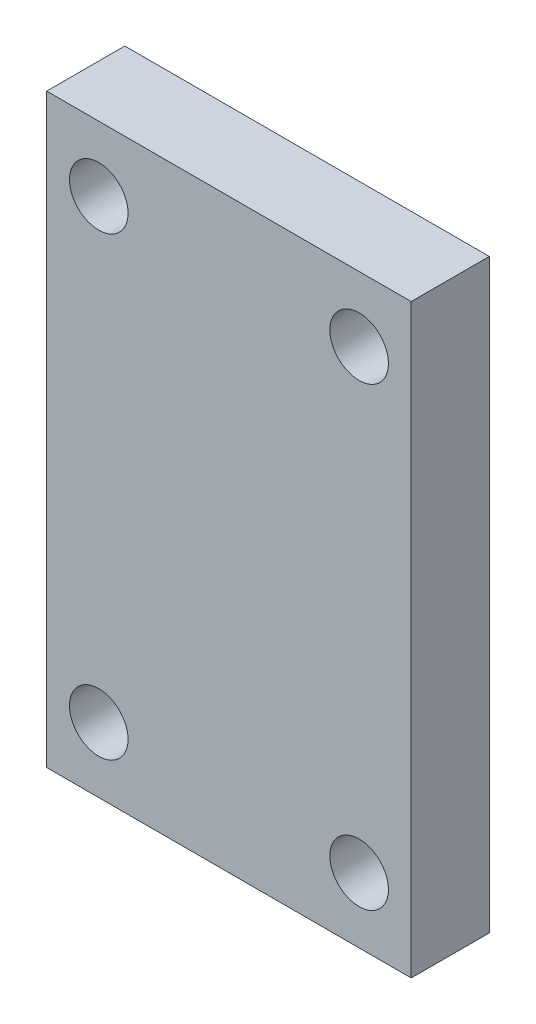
ISO-10303-21;
HEADER;
FILE_DESCRIPTION(('STEP AP214'),'2;1');
FILE_NAME('part.step','',(''),(''),'','','');
FILE_SCHEMA(('AUTOMOTIVE_DESIGN { 1 0 10303 214 1 1 1 1 }'));
ENDSEC;
DATA;
#1=APPLICATION_CONTEXT('core data for automotive mechanical design processes');
#2=APPLICATION_PROTOCOL_DEFINITION('international standard','automotive_design',2000,#1);
#3=PRODUCT_CONTEXT('',#1,'mechanical');
#4=PRODUCT('Part','Part','',(#3));
#5=PRODUCT_RELATED_PRODUCT_CATEGORY('part','',(#4));
#6=PRODUCT_DEFINITION_FORMATION('','',#4);
#7=PRODUCT_DEFINITION_CONTEXT('part definition',#1,'design');
#8=PRODUCT_DEFINITION('design','',#6,#7);
#9=PRODUCT_DEFINITION_SHAPE('','',#8);
#10=(LENGTH_UNIT() NAMED_UNIT(*) SI_UNIT(.MILLI.,.METRE.));
#11=(NAMED_UNIT(*) PLANE_ANGLE_UNIT() SI_UNIT($,.RADIAN.));
#12=(NAMED_UNIT(*) SI_UNIT($,.STERADIAN.) SOLID_ANGLE_UNIT());
#13=UNCERTAINTY_MEASURE_WITH_UNIT(LENGTH_MEASURE(1.E-05),#10,'distance_accuracy_value','');
#14=(GEOMETRIC_REPRESENTATION_CONTEXT(3) GLOBAL_UNCERTAINTY_ASSIGNED_CONTEXT((#13)) GLOBAL_UNIT_ASSIGNED_CONTEXT((#10,
#11,#12)) REPRESENTATION_CONTEXT('',''));
#15=CARTESIAN_POINT('',(0.,0.,0.));
#16=DIRECTION('',(0.,0.,1.));
#17=DIRECTION('',(1.,0.,0.));
#18=AXIS2_PLACEMENT_3D('',#15,#16,#17);
#19=CARTESIAN_POINT('',(0.,0.,6.));
#20=DIRECTION('',(0.,0.,-1.));
#21=DIRECTION('',(-1.,0.,0.));
#22=AXIS2_PLACEMENT_3D('',#19,#20,#21);
#23=PLANE('',#22);
#24=CARTESIAN_POINT('',(4.,-40.,6.));
#25=DIRECTION('',(0.,0.,1.));
#26=DIRECTION('',(1.,0.,0.));
#27=AXIS2_PLACEMENT_3D('',#24,#25,#26);
#28=CIRCLE('',#27,2.25);
#29=CARTESIAN_POINT('',(6.25,-40.,6.));
#30=VERTEX_POINT('',#29);
#31=EDGE_CURVE('E120',#30,#30,#28,.T.);
#32=ORIENTED_EDGE('',*,*,#31,.F.);
#33=EDGE_LOOP('',(#32));
#34=FACE_BOUND('',#33,.T.);
#35=CARTESIAN_POINT('',(24.,-5.,6.));
#36=DIRECTION('',(0.,0.,1.));
#37=DIRECTION('',(1.,0.,0.));
#38=AXIS2_PLACEMENT_3D('',#35,#36,#37);
#39=CIRCLE('',#38,2.25);
#40=CARTESIAN_POINT('',(26.25,-5.,6.));
#41=VERTEX_POINT('',#40);
#42=EDGE_CURVE('E99',#41,#41,#39,.T.);
#43=ORIENTED_EDGE('',*,*,#42,.F.);
#44=EDGE_LOOP('',(#43));
#45=FACE_BOUND('',#44,.T.);
#46=DIRECTION('',(0.,-1.,0.));
#47=VECTOR('',#46,1.);
#48=CARTESIAN_POINT('',(0.,-45.,6.));
#49=LINE('',#48,#47);
#50=CARTESIAN_POINT('',(0.,0.,6.));
#51=VERTEX_POINT('',#50);
#52=CARTESIAN_POINT('',(0.,-45.,6.));
#53=VERTEX_POINT('',#52);
#54=EDGE_CURVE('E84',#51,#53,#49,.T.);
#55=ORIENTED_EDGE('',*,*,#54,.T.);
#56=DIRECTION('',(1.,0.,0.));
#57=VECTOR('',#56,1.);
#58=CARTESIAN_POINT('',(0.,-45.,6.));
#59=LINE('',#58,#57);
#60=CARTESIAN_POINT('',(28.,-45.,6.));
#61=VERTEX_POINT('',#60);
#62=EDGE_CURVE('E79',#53,#61,#59,.T.);
#63=ORIENTED_EDGE('',*,*,#62,.T.);
#64=DIRECTION('',(0.,1.,0.));
#65=VECTOR('',#64,1.);
#66=CARTESIAN_POINT('',(28.,-45.,6.));
#67=LINE('',#66,#65);
#68=CARTESIAN_POINT('',(28.,0.,6.));
#69=VERTEX_POINT('',#68);
#70=EDGE_CURVE('E82',#61,#69,#67,.T.);
#71=ORIENTED_EDGE('',*,*,#70,.T.);
#72=DIRECTION('',(-1.,0.,0.));
#73=VECTOR('',#72,1.);
#74=CARTESIAN_POINT('',(0.,0.,6.));
#75=LINE('',#74,#73);
#76=EDGE_CURVE('E49',#69,#51,#75,.T.);
#77=ORIENTED_EDGE('',*,*,#76,.T.);
#78=EDGE_LOOP('',(#55,#63,#71,#77));
#79=FACE_BOUND('',#78,.T.);
#80=CARTESIAN_POINT('',(4.,-5.,6.));
#81=DIRECTION('',(0.,0.,1.));
#82=DIRECTION('',(1.,0.,0.));
#83=AXIS2_PLACEMENT_3D('',#80,#81,#82);
#84=CIRCLE('',#83,2.25);
#85=CARTESIAN_POINT('',(6.25,-5.,6.));
#86=VERTEX_POINT('',#85);
#87=EDGE_CURVE('E114',#86,#86,#84,.T.);
#88=ORIENTED_EDGE('',*,*,#87,.F.);
#89=EDGE_LOOP('',(#88));
#90=FACE_BOUND('',#89,.T.);
#91=CARTESIAN_POINT('',(24.,-40.,6.));
#92=DIRECTION('',(0.,0.,1.));
#93=DIRECTION('',(1.,0.,0.));
#94=AXIS2_PLACEMENT_3D('',#91,#92,#93);
#95=CIRCLE('',#94,2.25);
#96=CARTESIAN_POINT('',(26.25,-40.,6.));
#97=VERTEX_POINT('',#96);
#98=EDGE_CURVE('E126',#97,#97,#95,.T.);
#99=ORIENTED_EDGE('',*,*,#98,.F.);
#100=EDGE_LOOP('',(#99));
#101=FACE_BOUND('',#100,.T.);
#102=ADVANCED_FACE('F32',(#34,#45,#79,#90,#101),#23,.F.);
#103=CARTESIAN_POINT('',(0.,0.,0.));
#104=DIRECTION('',(0.,0.,-1.));
#105=DIRECTION('',(-1.,0.,0.));
#106=AXIS2_PLACEMENT_3D('',#103,#104,#105);
#107=PLANE('',#106);
#108=CARTESIAN_POINT('',(4.,-40.,0.));
#109=DIRECTION('',(0.,0.,1.));
#110=DIRECTION('',(1.,0.,0.));
#111=AXIS2_PLACEMENT_3D('',#108,#109,#110);
#112=CIRCLE('',#111,2.25);
#113=CARTESIAN_POINT('',(6.25,-40.,0.));
#114=VERTEX_POINT('',#113);
#115=EDGE_CURVE('E123',#114,#114,#112,.T.);
#116=ORIENTED_EDGE('',*,*,#115,.T.);
#117=EDGE_LOOP('',(#116));
#118=FACE_BOUND('',#117,.T.);
#119=CARTESIAN_POINT('',(24.,-5.,0.));
#120=DIRECTION('',(0.,0.,1.));
#121=DIRECTION('',(1.,0.,0.));
#122=AXIS2_PLACEMENT_3D('',#119,#120,#121);
#123=CIRCLE('',#122,2.25);
#124=CARTESIAN_POINT('',(26.25,-5.,0.));
#125=VERTEX_POINT('',#124);
#126=EDGE_CURVE('E111',#125,#125,#123,.T.);
#127=ORIENTED_EDGE('',*,*,#126,.T.);
#128=EDGE_LOOP('',(#127));
#129=FACE_BOUND('',#128,.T.);
#130=DIRECTION('',(0.,-1.,0.));
#131=VECTOR('',#130,1.);
#132=CARTESIAN_POINT('',(0.,-45.,0.));
#133=LINE('',#132,#131);
#134=CARTESIAN_POINT('',(0.,0.,0.));
#135=VERTEX_POINT('',#134);
#136=CARTESIAN_POINT('',(0.,-45.,0.));
#137=VERTEX_POINT('',#136);
#138=EDGE_CURVE('E96',#135,#137,#133,.T.);
#139=ORIENTED_EDGE('',*,*,#138,.F.);
#140=DIRECTION('',(-1.,0.,0.));
#141=VECTOR('',#140,1.);
#142=CARTESIAN_POINT('',(0.,0.,0.));
#143=LINE('',#142,#141);
#144=CARTESIAN_POINT('',(28.,0.,0.));
#145=VERTEX_POINT('',#144);
#146=EDGE_CURVE('E72',#145,#135,#143,.T.);
#147=ORIENTED_EDGE('',*,*,#146,.F.);
#148=DIRECTION('',(0.,1.,0.));
#149=VECTOR('',#148,1.);
#150=CARTESIAN_POINT('',(28.,-45.,0.));
#151=LINE('',#150,#149);
#152=CARTESIAN_POINT('',(28.,-45.,0.));
#153=VERTEX_POINT('',#152);
#154=EDGE_CURVE('E66',#153,#145,#151,.T.);
#155=ORIENTED_EDGE('',*,*,#154,.F.);
#156=DIRECTION('',(1.,0.,0.));
#157=VECTOR('',#156,1.);
#158=CARTESIAN_POINT('',(0.,-45.,0.));
#159=LINE('',#158,#157);
#160=EDGE_CURVE('E88',#137,#153,#159,.T.);
#161=ORIENTED_EDGE('',*,*,#160,.F.);
#162=EDGE_LOOP('',(#139,#147,#155,#161));
#163=FACE_BOUND('',#162,.T.);
#164=CARTESIAN_POINT('',(4.,-5.,0.));
#165=DIRECTION('',(0.,0.,1.));
#166=DIRECTION('',(1.,0.,0.));
#167=AXIS2_PLACEMENT_3D('',#164,#165,#166);
#168=CIRCLE('',#167,2.25);
#169=CARTESIAN_POINT('',(6.25,-5.,0.));
#170=VERTEX_POINT('',#169);
#171=EDGE_CURVE('E117',#170,#170,#168,.T.);
#172=ORIENTED_EDGE('',*,*,#171,.T.);
#173=EDGE_LOOP('',(#172));
#174=FACE_BOUND('',#173,.T.);
#175=CARTESIAN_POINT('',(24.,-40.,0.));
#176=DIRECTION('',(0.,0.,1.));
#177=DIRECTION('',(1.,0.,0.));
#178=AXIS2_PLACEMENT_3D('',#175,#176,#177);
#179=CIRCLE('',#178,2.25);
#180=CARTESIAN_POINT('',(26.25,-40.,0.));
#181=VERTEX_POINT('',#180);
#182=EDGE_CURVE('E129',#181,#181,#179,.T.);
#183=ORIENTED_EDGE('',*,*,#182,.T.);
#184=EDGE_LOOP('',(#183));
#185=FACE_BOUND('',#184,.T.);
#186=ADVANCED_FACE('F107',(#118,#129,#163,#174,#185),#107,.T.);
#187=CARTESIAN_POINT('',(0.,-45.,6.));
#188=DIRECTION('',(1.,0.,0.));
#189=DIRECTION('',(0.,0.,-1.));
#190=AXIS2_PLACEMENT_3D('',#187,#188,#189);
#191=PLANE('',#190);
#192=ORIENTED_EDGE('',*,*,#138,.T.);
#193=DIRECTION('',(0.,0.,-1.));
#194=VECTOR('',#193,1.);
#195=CARTESIAN_POINT('',(0.,-45.,6.));
#196=LINE('',#195,#194);
#197=EDGE_CURVE('E11',#53,#137,#196,.T.);
#198=ORIENTED_EDGE('',*,*,#197,.F.);
#199=ORIENTED_EDGE('',*,*,#54,.F.);
#200=DIRECTION('',(0.,0.,-1.));
#201=VECTOR('',#200,1.);
#202=CARTESIAN_POINT('',(0.,0.,6.));
#203=LINE('',#202,#201);
#204=EDGE_CURVE('E92',#51,#135,#203,.T.);
#205=ORIENTED_EDGE('',*,*,#204,.T.);
#206=EDGE_LOOP('',(#192,#198,#199,#205));
#207=FACE_BOUND('',#206,.T.);
#208=ADVANCED_FACE('F34',(#207),#191,.F.);
#209=CARTESIAN_POINT('',(0.,-45.,6.));
#210=DIRECTION('',(0.,1.,0.));
#211=DIRECTION('',(0.,0.,1.));
#212=AXIS2_PLACEMENT_3D('',#209,#210,#211);
#213=PLANE('',#212);
#214=ORIENTED_EDGE('',*,*,#160,.T.);
#215=DIRECTION('',(0.,0.,-1.));
#216=VECTOR('',#215,1.);
#217=CARTESIAN_POINT('',(28.,-45.,6.));
#218=LINE('',#217,#216);
#219=EDGE_CURVE('E41',#61,#153,#218,.T.);
#220=ORIENTED_EDGE('',*,*,#219,.F.);
#221=ORIENTED_EDGE('',*,*,#62,.F.);
#222=ORIENTED_EDGE('',*,*,#197,.T.);
#223=EDGE_LOOP('',(#214,#220,#221,#222));
#224=FACE_BOUND('',#223,.T.);
#225=ADVANCED_FACE('F87',(#224),#213,.F.);
#226=CARTESIAN_POINT('',(28.,-45.,6.));
#227=DIRECTION('',(-1.,0.,0.));
#228=DIRECTION('',(0.,0.,1.));
#229=AXIS2_PLACEMENT_3D('',#226,#227,#228);
#230=PLANE('',#229);
#231=ORIENTED_EDGE('',*,*,#154,.T.);
#232=DIRECTION('',(0.,0.,-1.));
#233=VECTOR('',#232,1.);
#234=CARTESIAN_POINT('',(28.,0.,6.));
#235=LINE('',#234,#233);
#236=EDGE_CURVE('E89',#69,#145,#235,.T.);
#237=ORIENTED_EDGE('',*,*,#236,.F.);
#238=ORIENTED_EDGE('',*,*,#70,.F.);
#239=ORIENTED_EDGE('',*,*,#219,.T.);
#240=EDGE_LOOP('',(#231,#237,#238,#239));
#241=FACE_BOUND('',#240,.T.);
#242=ADVANCED_FACE('F90',(#241),#230,.F.);
#243=CARTESIAN_POINT('',(0.,0.,6.));
#244=DIRECTION('',(0.,-1.,0.));
#245=DIRECTION('',(0.,0.,-1.));
#246=AXIS2_PLACEMENT_3D('',#243,#244,#245);
#247=PLANE('',#246);
#248=ORIENTED_EDGE('',*,*,#146,.T.);
#249=ORIENTED_EDGE('',*,*,#204,.F.);
#250=ORIENTED_EDGE('',*,*,#76,.F.);
#251=ORIENTED_EDGE('',*,*,#236,.T.);
#252=EDGE_LOOP('',(#248,#249,#250,#251));
#253=FACE_BOUND('',#252,.T.);
#254=ADVANCED_FACE('F104',(#253),#247,.F.);
#255=CARTESIAN_POINT('',(24.,-5.,6.));
#256=DIRECTION('',(0.,0.,-1.));
#257=DIRECTION('',(-1.,0.,0.));
#258=AXIS2_PLACEMENT_3D('',#255,#256,#257);
#259=CYLINDRICAL_SURFACE('',#258,2.25);
#260=ORIENTED_EDGE('',*,*,#42,.T.);
#261=EDGE_LOOP('',(#260));
#262=FACE_BOUND('',#261,.T.);
#263=ORIENTED_EDGE('',*,*,#126,.F.);
#264=EDGE_LOOP('',(#263));
#265=FACE_BOUND('',#264,.T.);
#266=ADVANCED_FACE('F149',(#262,#265),#259,.F.);
#267=CARTESIAN_POINT('',(4.,-5.,6.));
#268=DIRECTION('',(0.,0.,-1.));
#269=DIRECTION('',(-1.,0.,0.));
#270=AXIS2_PLACEMENT_3D('',#267,#268,#269);
#271=CYLINDRICAL_SURFACE('',#270,2.25);
#272=ORIENTED_EDGE('',*,*,#87,.T.);
#273=EDGE_LOOP('',(#272));
#274=FACE_BOUND('',#273,.T.);
#275=ORIENTED_EDGE('',*,*,#171,.F.);
#276=EDGE_LOOP('',(#275));
#277=FACE_BOUND('',#276,.T.);
#278=ADVANCED_FACE('F195',(#274,#277),#271,.F.);
#279=CARTESIAN_POINT('',(4.,-40.,6.));
#280=DIRECTION('',(0.,0.,-1.));
#281=DIRECTION('',(-1.,0.,0.));
#282=AXIS2_PLACEMENT_3D('',#279,#280,#281);
#283=CYLINDRICAL_SURFACE('',#282,2.25);
#284=ORIENTED_EDGE('',*,*,#31,.T.);
#285=EDGE_LOOP('',(#284));
#286=FACE_BOUND('',#285,.T.);
#287=ORIENTED_EDGE('',*,*,#115,.F.);
#288=EDGE_LOOP('',(#287));
#289=FACE_BOUND('',#288,.T.);
#290=ADVANCED_FACE('F203',(#286,#289),#283,.F.);
#291=CARTESIAN_POINT('',(24.,-40.,6.));
#292=DIRECTION('',(0.,0.,-1.));
#293=DIRECTION('',(-1.,0.,0.));
#294=AXIS2_PLACEMENT_3D('',#291,#292,#293);
#295=CYLINDRICAL_SURFACE('',#294,2.25);
#296=ORIENTED_EDGE('',*,*,#98,.T.);
#297=EDGE_LOOP('',(#296));
#298=FACE_BOUND('',#297,.T.);
#299=ORIENTED_EDGE('',*,*,#182,.F.);
#300=EDGE_LOOP('',(#299));
#301=FACE_BOUND('',#300,.T.);
#302=ADVANCED_FACE('F135',(#298,#301),#295,.F.);
#303=CLOSED_SHELL('',(#102,#186,#208,#225,#242,#254,#266,#278,#290,#302));
#304=MANIFOLD_SOLID_BREP('B2',#303);
#305=ADVANCED_BREP_SHAPE_REPRESENTATION('',(#18,#304),#14);
#306=SHAPE_DEFINITION_REPRESENTATION(#9,#305);
ENDSEC;
END-ISO-10303-21;
